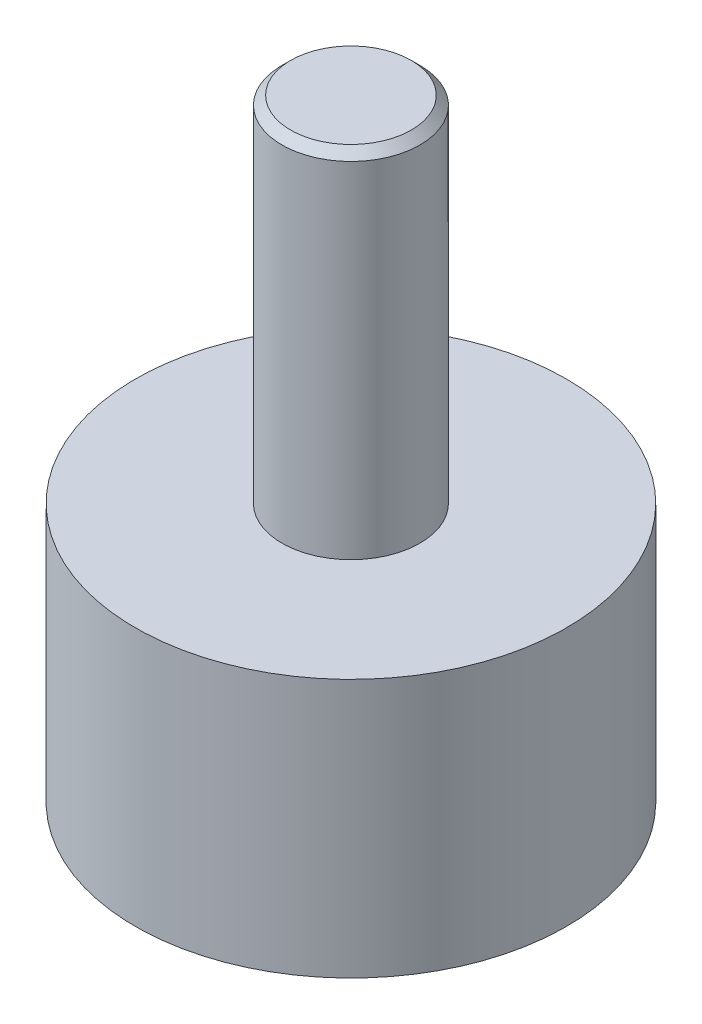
ISO-10303-21;
HEADER;
FILE_DESCRIPTION(('STEP AP214'),'2;1');
FILE_NAME('part.step','',(''),(''),'','','');
FILE_SCHEMA(('AUTOMOTIVE_DESIGN { 1 0 10303 214 1 1 1 1 }'));
ENDSEC;
DATA;
#1=APPLICATION_CONTEXT('core data for automotive mechanical design processes');
#2=APPLICATION_PROTOCOL_DEFINITION('international standard','automotive_design',2000,#1);
#3=PRODUCT_CONTEXT('',#1,'mechanical');
#4=PRODUCT('Part','Part','',(#3));
#5=PRODUCT_RELATED_PRODUCT_CATEGORY('part','',(#4));
#6=PRODUCT_DEFINITION_FORMATION('','',#4);
#7=PRODUCT_DEFINITION_CONTEXT('part definition',#1,'design');
#8=PRODUCT_DEFINITION('design','',#6,#7);
#9=PRODUCT_DEFINITION_SHAPE('','',#8);
#10=(LENGTH_UNIT() NAMED_UNIT(*) SI_UNIT(.MILLI.,.METRE.));
#11=(NAMED_UNIT(*) PLANE_ANGLE_UNIT() SI_UNIT($,.RADIAN.));
#12=(NAMED_UNIT(*) SI_UNIT($,.STERADIAN.) SOLID_ANGLE_UNIT());
#13=UNCERTAINTY_MEASURE_WITH_UNIT(LENGTH_MEASURE(1.E-05),#10,'distance_accuracy_value','');
#14=(GEOMETRIC_REPRESENTATION_CONTEXT(3) GLOBAL_UNCERTAINTY_ASSIGNED_CONTEXT((#13)) GLOBAL_UNIT_ASSIGNED_CONTEXT((#10,
#11,#12)) REPRESENTATION_CONTEXT('',''));
#15=CARTESIAN_POINT('',(0.,0.,0.));
#16=DIRECTION('',(0.,0.,1.));
#17=DIRECTION('',(1.,0.,0.));
#18=AXIS2_PLACEMENT_3D('',#15,#16,#17);
#19=CARTESIAN_POINT('',(0.,0.,0.));
#20=DIRECTION('',(0.,1.,0.));
#21=DIRECTION('',(0.,0.,1.));
#22=AXIS2_PLACEMENT_3D('',#19,#20,#21);
#23=PLANE('',#22);
#24=CARTESIAN_POINT('',(0.,0.,0.));
#25=DIRECTION('',(0.,-1.,0.));
#26=DIRECTION('',(0.,0.,-1.));
#27=AXIS2_PLACEMENT_3D('',#24,#25,#26);
#28=CIRCLE('',#27,12.5);
#29=CARTESIAN_POINT('',(0.,0.,-12.5));
#30=VERTEX_POINT('',#29);
#31=EDGE_CURVE('E10',#30,#30,#28,.T.);
#32=ORIENTED_EDGE('',*,*,#31,.T.);
#33=EDGE_LOOP('',(#32));
#34=FACE_BOUND('',#33,.T.);
#35=ADVANCED_FACE('F28',(#34),#23,.F.);
#36=CARTESIAN_POINT('',(0.,0.,0.));
#37=DIRECTION('',(0.,-1.,0.));
#38=DIRECTION('',(0.,0.,-1.));
#39=AXIS2_PLACEMENT_3D('',#36,#37,#38);
#40=CYLINDRICAL_SURFACE('',#39,12.5);
#41=ORIENTED_EDGE('',*,*,#31,.F.);
#42=EDGE_LOOP('',(#41));
#43=FACE_BOUND('',#42,.T.);
#44=CARTESIAN_POINT('',(0.,15.,0.));
#45=DIRECTION('',(0.,-1.,0.));
#46=DIRECTION('',(0.,0.,-1.));
#47=AXIS2_PLACEMENT_3D('',#44,#45,#46);
#48=CIRCLE('',#47,12.5);
#49=CARTESIAN_POINT('',(0.,15.,-12.5));
#50=VERTEX_POINT('',#49);
#51=EDGE_CURVE('E34',#50,#50,#48,.T.);
#52=ORIENTED_EDGE('',*,*,#51,.T.);
#53=EDGE_LOOP('',(#52));
#54=FACE_BOUND('',#53,.T.);
#55=ADVANCED_FACE('F63',(#43,#54),#40,.T.);
#56=CARTESIAN_POINT('',(-12.5,15.,0.));
#57=DIRECTION('',(0.,-1.,0.));
#58=DIRECTION('',(0.,0.,-1.));
#59=AXIS2_PLACEMENT_3D('',#56,#57,#58);
#60=PLANE('',#59);
#61=ORIENTED_EDGE('',*,*,#51,.F.);
#62=EDGE_LOOP('',(#61));
#63=FACE_BOUND('',#62,.T.);
#64=CARTESIAN_POINT('',(0.,15.,0.));
#65=DIRECTION('',(0.,-1.,0.));
#66=DIRECTION('',(0.,0.,-1.));
#67=AXIS2_PLACEMENT_3D('',#64,#65,#66);
#68=CIRCLE('',#67,4.);
#69=CARTESIAN_POINT('',(0.,15.,-4.));
#70=VERTEX_POINT('',#69);
#71=EDGE_CURVE('E38',#70,#70,#68,.T.);
#72=ORIENTED_EDGE('',*,*,#71,.T.);
#73=EDGE_LOOP('',(#72));
#74=FACE_BOUND('',#73,.T.);
#75=ADVANCED_FACE('F67',(#63,#74),#60,.F.);
#76=CARTESIAN_POINT('',(0.,0.,0.));
#77=DIRECTION('',(0.,-1.,0.));
#78=DIRECTION('',(0.,0.,-1.));
#79=AXIS2_PLACEMENT_3D('',#76,#77,#78);
#80=CYLINDRICAL_SURFACE('',#79,4.);
#81=ORIENTED_EDGE('',*,*,#71,.F.);
#82=EDGE_LOOP('',(#81));
#83=FACE_BOUND('',#82,.T.);
#84=CARTESIAN_POINT('',(0.,35.,0.));
#85=DIRECTION('',(0.,-1.,0.));
#86=DIRECTION('',(0.,0.,-1.));
#87=AXIS2_PLACEMENT_3D('',#84,#85,#86);
#88=CIRCLE('',#87,4.);
#89=CARTESIAN_POINT('',(0.,35.,-4.));
#90=VERTEX_POINT('',#89);
#91=EDGE_CURVE('E42',#90,#90,#88,.T.);
#92=ORIENTED_EDGE('',*,*,#91,.T.);
#93=EDGE_LOOP('',(#92));
#94=FACE_BOUND('',#93,.T.);
#95=ADVANCED_FACE('F59',(#83,#94),#80,.T.);
#96=CARTESIAN_POINT('',(0.,35.5,0.));
#97=DIRECTION('',(0.,-1.,0.));
#98=DIRECTION('',(0.,0.,-1.));
#99=AXIS2_PLACEMENT_3D('',#96,#97,#98);
#100=CONICAL_SURFACE('',#99,3.49999999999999,0.785398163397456);
#101=ORIENTED_EDGE('',*,*,#91,.F.);
#102=EDGE_LOOP('',(#101));
#103=FACE_BOUND('',#102,.T.);
#104=CARTESIAN_POINT('',(0.,35.5,0.));
#105=DIRECTION('',(0.,-1.,0.));
#106=DIRECTION('',(0.,0.,-1.));
#107=AXIS2_PLACEMENT_3D('',#104,#105,#106);
#108=CIRCLE('',#107,3.49999999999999);
#109=CARTESIAN_POINT('',(0.,35.5,-3.49999999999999));
#110=VERTEX_POINT('',#109);
#111=EDGE_CURVE('E47',#110,#110,#108,.T.);
#112=ORIENTED_EDGE('',*,*,#111,.T.);
#113=EDGE_LOOP('',(#112));
#114=FACE_BOUND('',#113,.T.);
#115=ADVANCED_FACE('F51',(#103,#114),#100,.T.);
#116=CARTESIAN_POINT('',(-3.49999999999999,35.5,0.));
#117=DIRECTION('',(0.,-1.,0.));
#118=DIRECTION('',(0.,0.,-1.));
#119=AXIS2_PLACEMENT_3D('',#116,#117,#118);
#120=PLANE('',#119);
#121=ORIENTED_EDGE('',*,*,#111,.F.);
#122=EDGE_LOOP('',(#121));
#123=FACE_BOUND('',#122,.T.);
#124=ADVANCED_FACE('F53',(#123),#120,.F.);
#125=CLOSED_SHELL('',(#35,#55,#75,#95,#115,#124));
#126=MANIFOLD_SOLID_BREP('B2',#125);
#127=ADVANCED_BREP_SHAPE_REPRESENTATION('',(#18,#126),#14);
#128=SHAPE_DEFINITION_REPRESENTATION(#9,#127);
ENDSEC;
END-ISO-10303-21;
